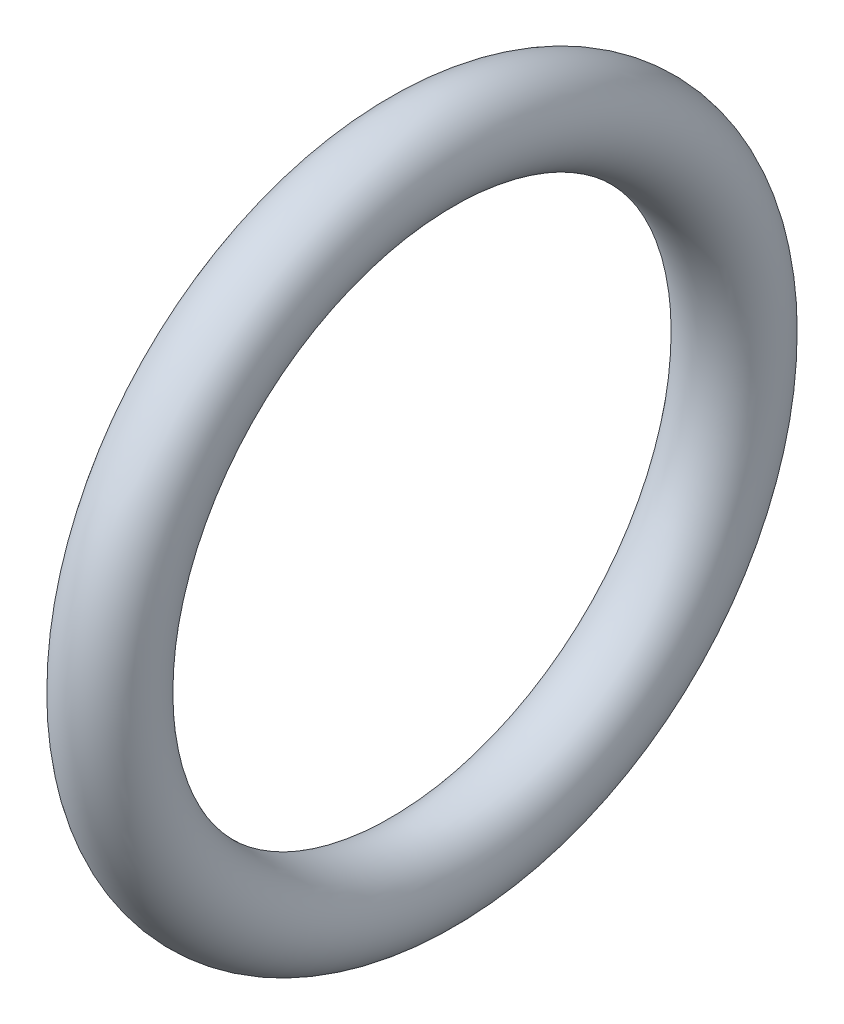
from build123d import *

# Parameters (mm, degrees)
ESQUISSE1_R = 1.5


with BuildPart() as part:
    # Esquisse1 → Base-R_volution (revolve)
    with BuildSketch(Plane.XY, mode=Mode.PRIVATE) as base_r_volution_sk:
        with Locations((-1.5, 10.5)):
            Circle(ESQUISSE1_R)
    revolve(base_r_volution_sk.sketch.rotate(Axis((60, 0, 0), (-1, 0, 0)), 90), axis=Axis((60, 0, 0), (-1, 0, 0)))


solid = part.part
